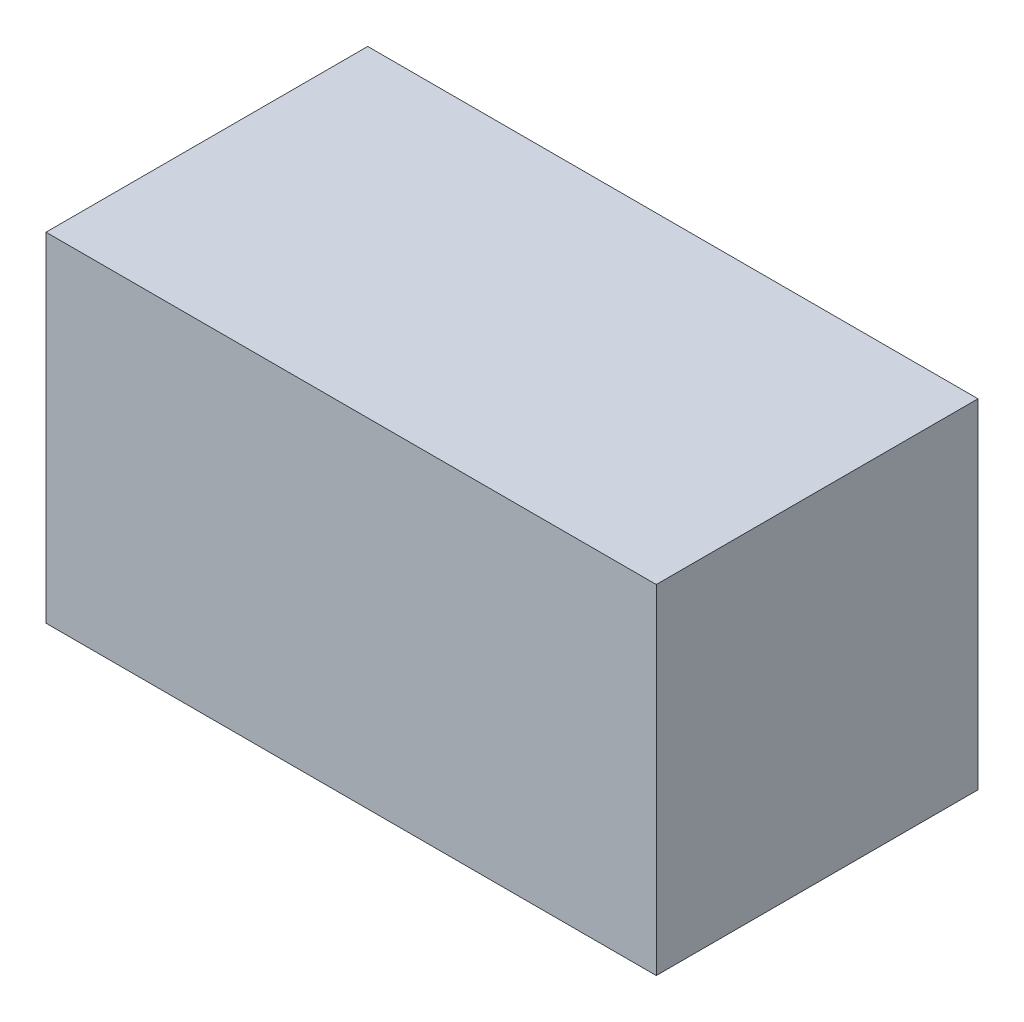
from build123d import *

# Parameters (mm, degrees)
SKETCH1_W           = 18.02
SKETCH1_H           = 9.5
BOSS_EXTRUDE1_DEPTH = 10


with BuildPart() as part:
    # Sketch1 → Boss-Extrude1 (new body)
    with BuildSketch(Plane(origin=(0, 0, 0), x_dir=(1, 0, 0), z_dir=(0, 1, 0))):
        with Locations((9.01, -4.75)):
            Rectangle(SKETCH1_W, SKETCH1_H)
    extrude(amount=BOSS_EXTRUDE1_DEPTH)


solid = part.part
